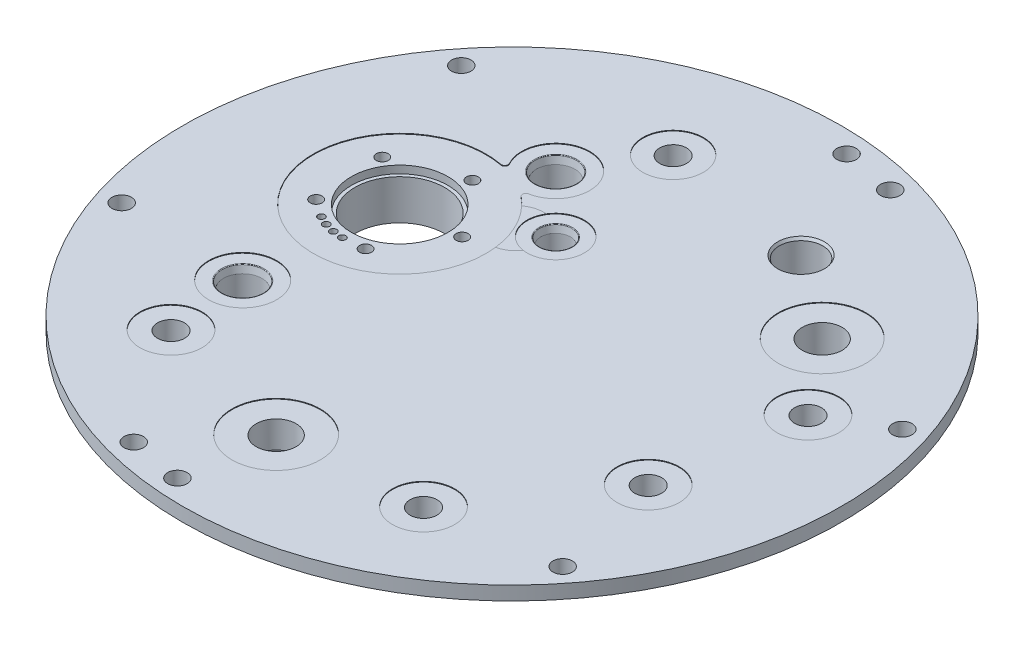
from build123d import *

# Parameters (mm, degrees)
CTD_PORT_D                                       = 33.02
CTD_PORT_CBORE_D                                 = 35.56
CTD_PORT_CBORE_DEPTH                             = 3.048
SKETCH237_R                                      = 31.75
CUT_EXTRUDE1_DEPTH                               = 0.254
F_38_0_1015_DIAMETER_HOLE1_D                     = 2.54
F_17_0_173_DIAMETER_HOLE1_D                      = 4.3942
FILLET1_R                                        = 1.27
F_4_40_TAPPED_HOLE2_D                            = 2.2606
F_4_40_TAPPED_HOLE2_DEPTH                        = 8.382
F_4_40_TAPPED_HOLE2_TIP                          = 0.679152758
THREAD_FOR_ANTENNA_PORT_D                        = 14.68374
ANTENNA_PORT_D                                   = 6.7564
ANTENNA_PORT_CBORE_D                             = 32.512
ANTENNA_PORT_CBORE_DEPTH                         = 0.254
THREAD_FOR_ANTENNA_PORT_2_D                      = 14.68374
CBORE_FOR_1_4_SOCKET_HEAD_CAP_SCREW2_D           = 6.7564
CBORE_FOR_1_4_SOCKET_HEAD_CAP_SCREW2_CBORE_D     = 28.575
CBORE_FOR_1_4_SOCKET_HEAD_CAP_SCREW2_CBORE_DEPTH = 7.62
SUBCONN_PORTS_D                                  = 2.54
SUBCONN_PORTS_DEPTH                              = 25.4
SUBCONN_PORTS_CBORE_D                            = 22.86
SUBCONN_PORTS_CBORE_DEPTH                        = 0.254
F_7_16_20_TAPPED_HOLE1_D                         = 9.92124
F_9_32_0_28125_DIAMETER_HOLE1_D                  = 7.14375
F_7_16_20_TAPPED_HOLE3_D                         = 9.92124
CBORE_FOR_7_16_HEX_HEAD_BOLT1_D                  = 9.92124
CBORE_FOR_7_16_HEX_HEAD_BOLT1_CBORE_D            = 22.2504
CBORE_FOR_7_16_HEX_HEAD_BOLT1_CBORE_DEPTH        = 0.254


with BuildPart() as part:
    # Sketch1 → Revolve1 (revolve)
    with BuildSketch(Plane.XY, mode=Mode.PRIVATE) as revolve1_sk:
        Polygon((0, 5.08), (-121.2215, 5.08), (-121.2215, 0), (-102.5779, 0), (-102.5779, -10.16), (-101.897309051, -12.7), (0, -12.7), align=None)
    revolve(revolve1_sk.sketch.rotate(Axis((0, -18.420388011, 0), (0, 1, 0)), 270), axis=Axis((0, -18.420388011, 0), (0, 1, 0)))

    # Sketch234 → 2-265 O-Ring (revolve, cut)
    with BuildSketch(Plane.XY, mode=Mode.PRIVATE) as f_2_265_o_ring_sk:
        with BuildLine():
            Line((-102.4509, -3.94335), (-100.1776, -3.94335))
            ThreePointArc((-100.1776, -3.94335), (-99.863291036, -4.073541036), (-99.7331, -4.38785))
            Line((-99.7331, -4.38785), (-99.7331, -8.31215))
            ThreePointArc((-99.7331, -8.31215), (-99.863291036, -8.626458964), (-100.1776, -8.75665))
            Line((-100.1776, -8.75665), (-102.4509, -8.75665))
            ThreePointArc((-102.4509, -8.75665), (-102.540702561, -8.793847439), (-102.5779, -8.88365))
            Line((-102.5779, -8.88365), (-102.5779, -3.81635))
            ThreePointArc((-102.5779, -3.81635), (-102.540702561, -3.906152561), (-102.4509, -3.94335))
        make_face()
    revolve(f_2_265_o_ring_sk.sketch.rotate(Axis((0, 0, 0), (0, -1, 0)), 270), axis=Axis((0, 0, 0), (0, -1, 0)), mode=Mode.SUBTRACT)

    # CTD Port (through all)
    with Locations(Plane(origin=(0, 5.08, 0), x_dir=(1, 0, 0), z_dir=(0, 1, 0))):
        with Locations((-56.429386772, 15.120208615)):
            CounterBoreHole(CTD_PORT_D / 2, CTD_PORT_CBORE_D / 2, CTD_PORT_CBORE_DEPTH)

    # Sketch237 → Cut-Extrude1 (cut)
    with BuildSketch(Plane(origin=(0, 5.08, 0), x_dir=(1, 0, 0), z_dir=(0, 1, 0))):
        with Locations(Location((-56.429386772, 15.120208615, 0), (0, 0, 270))):
            Circle(SKETCH237_R)
    extrude(amount=-CUT_EXTRUDE1_DEPTH, mode=Mode.SUBTRACT)

    # 38 _0.1015_ Diameter Hole1 (through all)
    with Locations(Plane(origin=(0, 5.08, 0), x_dir=(1, 0, 0), z_dir=(0, 1, 0))):
        with Locations((-66.970386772, -3.137338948), (-63.639855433, -4.690391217), (-60.090237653, -5.641508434), (-56.429386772, -5.961791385)):
            Hole(F_38_0_1015_DIAMETER_HOLE1_D / 2)

    # 17 _0.173_ Diameter Hole1 (through all)
    with Locations(Plane(origin=(0, 5.08, 0), x_dir=(1, 0, 0), z_dir=(0, 1, 0))):
        with Locations((-50.775743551, 36.219892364), (-74.749306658, 27.017303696), (-73.405363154, 1.373333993), (-48.601197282, -5.272922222), (-34.615323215, 16.263435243)):
            Hole(F_17_0_173_DIAMETER_HOLE1_D / 2)

    # Port Sketch1 → SAE Port1 (revolve, cut)
    with BuildSketch(Plane(origin=(-35.123411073, 5.08, -54.254578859), x_dir=(-1, 0, 0), z_dir=(0, 0, 1)), mode=Mode.PRIVATE) as sae_port1_sk:
        with BuildLine():
            Line((3.057319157, 54.988507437), (9.605439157, 51.054))
            Line((9.605439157, 51.054), (9.605439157, 12.954))
            Line((9.605439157, 12.954), (10.201069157, 12.954))
            Line((10.201069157, 12.954), (10.201069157, 2.880662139))
            Line((10.201069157, 2.880662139), (10.127731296, 2.954))
            Line((10.127731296, 2.954), (10.658869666, 0.455190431))
            ThreePointArc((10.658869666, 0.455190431), (10.747471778, 0.310604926), (10.907319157, 0.254))
            Line((10.907319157, 0.254), (15.557319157, 0.254))
            Line((15.557319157, 0.254), (15.557319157, 0))
            Line((15.557319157, 0), (3.057319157, 0))
            Line((3.057319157, 0), (3.057319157, 54.988507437))
        make_face()
    revolve(sae_port1_sk.sketch.rotate(Axis((-38.18073023, 5.08, -54.254578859), (0, -1, 0)), 270), axis=Axis((-38.18073023, 5.08, -54.254578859), (0, -1, 0)), mode=Mode.SUBTRACT)

    # Port Sketch2 → SAE Port2 (revolve, cut)
    with BuildSketch(Plane(origin=(-14.237697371, 5.08, -33.368865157), x_dir=(-1, 0, 0), z_dir=(0, 0, 1)), mode=Mode.PRIVATE) as sae_port2_sk:
        with BuildLine():
            Line((3.057319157, 54.034641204), (8.017939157, 51.054))
            Line((8.017939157, 51.054), (8.017939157, 11.754))
            Line((8.017939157, 11.754), (8.613569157, 11.754))
            Line((8.613569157, 11.754), (8.613569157, 2.764417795))
            Line((8.613569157, 2.764417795), (8.523986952, 2.854))
            Line((8.523986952, 2.854), (9.033869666, 0.455190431))
            ThreePointArc((9.033869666, 0.455190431), (9.122471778, 0.310604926), (9.282319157, 0.254))
            Line((9.282319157, 0.254), (13.557319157, 0.254))
            Line((13.557319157, 0.254), (13.557319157, 0))
            Line((13.557319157, 0), (3.057319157, 0))
            Line((3.057319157, 0), (3.057319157, 54.034641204))
        make_face()
    revolve(sae_port2_sk.sketch.rotate(Axis((-17.295016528, 5.08, -33.368865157), (0, -1, 0)), 270), axis=Axis((-17.295016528, 5.08, -33.368865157), (0, -1, 0)), mode=Mode.SUBTRACT)

    # Port Sketch → SAE Port (revolve, cut)
    with BuildSketch(Plane(origin=(-59.86751663, 5.08, 38.690676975), x_dir=(-0.8796575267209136, 0, -0.47560764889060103), z_dir=(-0.47560764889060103, 0, 0.8796575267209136)), mode=Mode.PRIVATE) as sae_port_sk:
        with BuildLine():
            Line((1.241941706, 19.688507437), (7.790061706, 15.754))
            Line((7.790061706, 15.754), (7.790061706, 12.954))
            Line((7.790061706, 12.954), (8.385691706, 12.954))
            Line((8.385691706, 12.954), (8.385691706, 2.880662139))
            Line((8.385691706, 2.880662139), (8.312353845, 2.954))
            Line((8.312353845, 2.954), (8.843492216, 0.455190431))
            ThreePointArc((8.843492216, 0.455190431), (8.932094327, 0.310604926), (9.091941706, 0.254))
            Line((9.091941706, 0.254), (13.741941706, 0.254))
            Line((13.741941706, 0.254), (13.741941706, 0))
            Line((13.741941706, 0), (1.241941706, 0))
            Line((1.241941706, 0), (1.241941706, 19.688507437))
        make_face()
    revolve(sae_port_sk.sketch.rotate(Axis((-60.96, 5.08, 38.1), (0, -1, 0)), 241.601078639), axis=Axis((-60.96, 5.08, 38.1), (0, -1, 0)), mode=Mode.SUBTRACT)

    # Fillet1
    fillet1_edges = [part.edges().sort_by_distance(p)[0] for p in [
        (-39.213244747, 4.953, -41.797295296),
        (-47.059875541, 4.953, -45.456239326),
    ]]
    fillet(fillet1_edges, radius=FILLET1_R)

    # Sketch41 → Optode Port (revolve, cut)
    with BuildSketch(Plane(origin=(33.813687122, -12.7, -72.513686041), x_dir=(0, 0, -1), z_dir=(1, 0, 0))):
        Polygon((0, 0), (0, 17.78), (8.606588, 17.78), (8.02, 16.763999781), (8.02, 5.08), (15.875, 5.08), (15.875, 0), align=None)
    revolve(axis=Axis((33.813687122, -19.05, -72.513686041), (0, 1, 0)), mode=Mode.SUBTRACT)

    # 4-40 Tapped Hole2
    with Locations(Plane(origin=(0, -12.7, 0), x_dir=(-1, 0, 0), z_dir=(0, -1, 0))):
        with Locations((-8.413687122, 72.513686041), (-59.213687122, 72.513686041)):
            Hole(F_4_40_TAPPED_HOLE2_D / 2, depth=F_4_40_TAPPED_HOLE2_DEPTH)
            with Locations((0, 0, -(F_4_40_TAPPED_HOLE2_DEPTH + F_4_40_TAPPED_HOLE2_TIP / 2))):  # 118° drill point
                Cone(0, F_4_40_TAPPED_HOLE2_D / 2, F_4_40_TAPPED_HOLE2_TIP, mode=Mode.SUBTRACT)

    # Thread For Antenna Port (through all)
    with Locations(Plane(origin=(0, 5.08, 0), x_dir=(1, 0, 0), z_dir=(0, 1, 0))):
        with Locations((-5.669806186, -81.082006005)):
            Hole(THREAD_FOR_ANTENNA_PORT_D / 2)

    # Antenna Port (through all)
    with Locations(Plane(origin=(0, 5.08, 0), x_dir=(1, 0, 0), z_dir=(0, 1, 0))):
        with Locations((-5.669806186, -81.082006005)):
            CounterBoreHole(ANTENNA_PORT_D / 2, ANTENNA_PORT_CBORE_D / 2, ANTENNA_PORT_CBORE_DEPTH)

    # Thread for Antenna Port 2 (through all)
    with Locations(Plane(origin=(0, 5.08, 0), x_dir=(1, 0, 0), z_dir=(0, 1, 0))):
        with Locations((64.049514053, 50.040964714)):
            Hole(THREAD_FOR_ANTENNA_PORT_2_D / 2)

    # Sketch227 → Antenna Port 2 (revolve, cut)
    with BuildSketch(Plane(origin=(64.049514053, 0, -37.589256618), x_dir=(0, 0, 1), z_dir=(-1, 0, 0)), mode=Mode.PRIVATE) as antenna_port_2_sk:
        Polygon((-12.451708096, 5.08), (-28.580708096, 5.08), (-28.580708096, 4.826), (-15.880708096, 4.826), (-15.880708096, -20.32), (-12.451708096, -20.32), align=None)
    revolve(antenna_port_2_sk.sketch.rotate(Axis((64.049514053, 17.727908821, -50.040964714), (0, -1, 0)), 180), axis=Axis((64.049514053, 17.727908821, -50.040964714), (0, -1, 0)), mode=Mode.SUBTRACT)

    # CBORE for 1_4 Socket Head Cap Screw2 (through all)
    with Locations(Plane(origin=(0, -12.7, 0), x_dir=(-1, 0, 0), z_dir=(0, -1, 0))):
        with Locations((5.669806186, -81.082006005)):
            CounterBoreHole(CBORE_FOR_1_4_SOCKET_HEAD_CAP_SCREW2_D / 2, CBORE_FOR_1_4_SOCKET_HEAD_CAP_SCREW2_CBORE_D / 2, CBORE_FOR_1_4_SOCKET_HEAD_CAP_SCREW2_CBORE_DEPTH)

    # Subconn Ports
    with Locations(Plane(origin=(0, 5.08, 0), x_dir=(1, 0, 0), z_dir=(0, 1, 0))):
        with Locations((85.870805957, 23.00901311), (-58.323647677, -67.093681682), (44.45, -76.989658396), (78.765035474, -28.668128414)):
            CounterBoreHole(SUBCONN_PORTS_D / 2, SUBCONN_PORTS_CBORE_D / 2, SUBCONN_PORTS_CBORE_DEPTH, depth=SUBCONN_PORTS_DEPTH)

    # 7_16-20 Tapped Hole1 (through all)
    with Locations(Plane(origin=(0, 5.08, 0), x_dir=(1, 0, 0), z_dir=(0, 1, 0))):
        with Locations((-58.323647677, -67.093681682), (44.45, -76.989658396), (78.765035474, -28.668128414), (85.870805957, 23.00901311)):
            Hole(F_7_16_20_TAPPED_HOLE1_D / 2)

    # 9_32 _0.28125_ Diameter Hole1 (through all)
    with Locations(Plane(origin=(0, 5.08, 0), x_dir=(1, 0, 0), z_dir=(0, 1, 0))):
        with Locations((29.402231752, 109.730622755), (9.90102311, 113.169211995), (-89.110796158, 70.459682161), (-107.835388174, -35.732756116), (-29.402231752, -109.730622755), (-9.90102311, -113.169211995), (89.110796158, -70.459682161), (107.835388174, 35.732756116)):
            Hole(F_9_32_0_28125_DIAMETER_HOLE1_D / 2)

    # 7_16-20 Tapped Hole3 (through all)
    with Locations(Plane(origin=(0, 5.08, 0), x_dir=(1, 0, 0), z_dir=(0, 1, 0))):
        with Locations((-21.69421236, 80.96390276)):
            Hole(F_7_16_20_TAPPED_HOLE3_D / 2)

    # CBORE for 7_16 Hex Head Bolt1 (through all)
    with Locations(Plane(origin=(0, 5.08, 0), x_dir=(1, 0, 0), z_dir=(0, 1, 0))):
        with Locations((-21.69421236, 80.96390276)):
            CounterBoreHole(CBORE_FOR_7_16_HEX_HEAD_BOLT1_D / 2, CBORE_FOR_7_16_HEX_HEAD_BOLT1_CBORE_D / 2, CBORE_FOR_7_16_HEX_HEAD_BOLT1_CBORE_DEPTH)


solid = part.part
